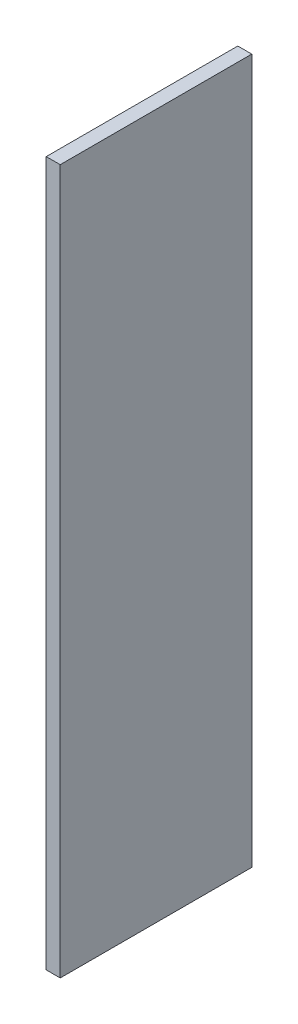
ISO-10303-21;
HEADER;
FILE_DESCRIPTION(('STEP AP214'),'2;1');
FILE_NAME('part.step','',(''),(''),'','','');
FILE_SCHEMA(('AUTOMOTIVE_DESIGN { 1 0 10303 214 1 1 1 1 }'));
ENDSEC;
DATA;
#1=APPLICATION_CONTEXT('core data for automotive mechanical design processes');
#2=APPLICATION_PROTOCOL_DEFINITION('international standard','automotive_design',2000,#1);
#3=PRODUCT_CONTEXT('',#1,'mechanical');
#4=PRODUCT('Part','Part','',(#3));
#5=PRODUCT_RELATED_PRODUCT_CATEGORY('part','',(#4));
#6=PRODUCT_DEFINITION_FORMATION('','',#4);
#7=PRODUCT_DEFINITION_CONTEXT('part definition',#1,'design');
#8=PRODUCT_DEFINITION('design','',#6,#7);
#9=PRODUCT_DEFINITION_SHAPE('','',#8);
#10=(LENGTH_UNIT() NAMED_UNIT(*) SI_UNIT(.MILLI.,.METRE.));
#11=(NAMED_UNIT(*) PLANE_ANGLE_UNIT() SI_UNIT($,.RADIAN.));
#12=(NAMED_UNIT(*) SI_UNIT($,.STERADIAN.) SOLID_ANGLE_UNIT());
#13=UNCERTAINTY_MEASURE_WITH_UNIT(LENGTH_MEASURE(1.E-05),#10,'distance_accuracy_value','');
#14=(GEOMETRIC_REPRESENTATION_CONTEXT(3) GLOBAL_UNCERTAINTY_ASSIGNED_CONTEXT((#13)) GLOBAL_UNIT_ASSIGNED_CONTEXT((#10,
#11,#12)) REPRESENTATION_CONTEXT('',''));
#15=CARTESIAN_POINT('',(0.,0.,0.));
#16=DIRECTION('',(0.,0.,1.));
#17=DIRECTION('',(1.,0.,0.));
#18=AXIS2_PLACEMENT_3D('',#15,#16,#17);
#19=CARTESIAN_POINT('',(-3.74999999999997,-57.5,192.228772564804));
#20=DIRECTION('',(1.,0.,0.));
#21=DIRECTION('',(0.,0.,-1.));
#22=AXIS2_PLACEMENT_3D('',#19,#20,#21);
#23=PLANE('',#22);
#24=DIRECTION('',(0.,-1.,0.));
#25=VECTOR('',#24,1.);
#26=CARTESIAN_POINT('',(-3.74999999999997,-57.5,41.0943887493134));
#27=LINE('',#26,#25);
#28=CARTESIAN_POINT('',(-3.74999999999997,93.604606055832,41.0943887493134));
#29=VERTEX_POINT('',#28);
#30=CARTESIAN_POINT('',(-3.74999999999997,-57.5,41.0943887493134));
#31=VERTEX_POINT('',#30);
#32=EDGE_CURVE('E86',#29,#31,#27,.T.);
#33=ORIENTED_EDGE('',*,*,#32,.F.);
#34=DIRECTION('',(0.,0.,-1.));
#35=VECTOR('',#34,1.);
#36=CARTESIAN_POINT('',(-3.74999999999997,93.604606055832,192.228772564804));
#37=LINE('',#36,#35);
#38=CARTESIAN_POINT('',(-3.74999999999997,93.604606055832,0.));
#39=VERTEX_POINT('',#38);
#40=EDGE_CURVE('E40',#29,#39,#37,.T.);
#41=ORIENTED_EDGE('',*,*,#40,.T.);
#42=DIRECTION('',(0.,-1.,0.));
#43=VECTOR('',#42,1.);
#44=CARTESIAN_POINT('',(-3.74999999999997,-57.5,0.));
#45=LINE('',#44,#43);
#46=CARTESIAN_POINT('',(-3.74999999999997,-57.5,0.));
#47=VERTEX_POINT('',#46);
#48=EDGE_CURVE('E84',#39,#47,#45,.T.);
#49=ORIENTED_EDGE('',*,*,#48,.T.);
#50=DIRECTION('',(0.,0.,-1.));
#51=VECTOR('',#50,1.);
#52=CARTESIAN_POINT('',(-3.74999999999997,-57.5,192.228772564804));
#53=LINE('',#52,#51);
#54=EDGE_CURVE('E75',#31,#47,#53,.T.);
#55=ORIENTED_EDGE('',*,*,#54,.F.);
#56=EDGE_LOOP('',(#33,#41,#49,#55));
#57=FACE_BOUND('',#56,.T.);
#58=ADVANCED_FACE('F36',(#57),#23,.F.);
#59=CARTESIAN_POINT('',(-3.74999999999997,-57.5,192.228772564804));
#60=DIRECTION('',(0.,1.,0.));
#61=DIRECTION('',(0.,0.,1.));
#62=AXIS2_PLACEMENT_3D('',#59,#60,#61);
#63=PLANE('',#62);
#64=DIRECTION('',(1.,0.,0.));
#65=VECTOR('',#64,1.);
#66=CARTESIAN_POINT('',(-3.74999999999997,-57.5,41.0943887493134));
#67=LINE('',#66,#65);
#68=CARTESIAN_POINT('',(-0.749999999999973,-57.5,41.0943887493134));
#69=VERTEX_POINT('',#68);
#70=EDGE_CURVE('E45',#31,#69,#67,.T.);
#71=ORIENTED_EDGE('',*,*,#70,.F.);
#72=ORIENTED_EDGE('',*,*,#54,.T.);
#73=DIRECTION('',(1.,0.,0.));
#74=VECTOR('',#73,1.);
#75=CARTESIAN_POINT('',(-3.74999999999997,-57.5,0.));
#76=LINE('',#75,#74);
#77=CARTESIAN_POINT('',(-0.749999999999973,-57.5,0.));
#78=VERTEX_POINT('',#77);
#79=EDGE_CURVE('E96',#47,#78,#76,.T.);
#80=ORIENTED_EDGE('',*,*,#79,.T.);
#81=DIRECTION('',(0.,0.,-1.));
#82=VECTOR('',#81,1.);
#83=CARTESIAN_POINT('',(-0.749999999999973,-57.5,192.228772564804));
#84=LINE('',#83,#82);
#85=EDGE_CURVE('E105',#69,#78,#84,.T.);
#86=ORIENTED_EDGE('',*,*,#85,.F.);
#87=EDGE_LOOP('',(#71,#72,#80,#86));
#88=FACE_BOUND('',#87,.T.);
#89=ADVANCED_FACE('F109',(#88),#63,.F.);
#90=CARTESIAN_POINT('',(-0.749999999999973,-57.5,192.228772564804));
#91=DIRECTION('',(-1.,0.,0.));
#92=DIRECTION('',(0.,0.,1.));
#93=AXIS2_PLACEMENT_3D('',#90,#91,#92);
#94=PLANE('',#93);
#95=DIRECTION('',(0.,1.,0.));
#96=VECTOR('',#95,1.);
#97=CARTESIAN_POINT('',(-0.749999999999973,-57.5,41.0943887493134));
#98=LINE('',#97,#96);
#99=CARTESIAN_POINT('',(-0.749999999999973,93.604606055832,41.0943887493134));
#100=VERTEX_POINT('',#99);
#101=EDGE_CURVE('E11',#69,#100,#98,.T.);
#102=ORIENTED_EDGE('',*,*,#101,.F.);
#103=ORIENTED_EDGE('',*,*,#85,.T.);
#104=DIRECTION('',(0.,1.,0.));
#105=VECTOR('',#104,1.);
#106=CARTESIAN_POINT('',(-0.749999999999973,-57.5,0.));
#107=LINE('',#106,#105);
#108=CARTESIAN_POINT('',(-0.749999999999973,93.604606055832,0.));
#109=VERTEX_POINT('',#108);
#110=EDGE_CURVE('E106',#78,#109,#107,.T.);
#111=ORIENTED_EDGE('',*,*,#110,.T.);
#112=DIRECTION('',(0.,0.,-1.));
#113=VECTOR('',#112,1.);
#114=CARTESIAN_POINT('',(-0.749999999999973,93.604606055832,192.228772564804));
#115=LINE('',#114,#113);
#116=EDGE_CURVE('E58',#100,#109,#115,.T.);
#117=ORIENTED_EDGE('',*,*,#116,.F.);
#118=EDGE_LOOP('',(#102,#103,#111,#117));
#119=FACE_BOUND('',#118,.T.);
#120=ADVANCED_FACE('F108',(#119),#94,.F.);
#121=CARTESIAN_POINT('',(-3.74999999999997,93.604606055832,192.228772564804));
#122=DIRECTION('',(0.,-1.,0.));
#123=DIRECTION('',(0.,0.,-1.));
#124=AXIS2_PLACEMENT_3D('',#121,#122,#123);
#125=PLANE('',#124);
#126=DIRECTION('',(-1.,0.,0.));
#127=VECTOR('',#126,1.);
#128=CARTESIAN_POINT('',(-3.74999999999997,93.604606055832,41.0943887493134));
#129=LINE('',#128,#127);
#130=EDGE_CURVE('E93',#100,#29,#129,.T.);
#131=ORIENTED_EDGE('',*,*,#130,.F.);
#132=ORIENTED_EDGE('',*,*,#116,.T.);
#133=DIRECTION('',(-1.,0.,0.));
#134=VECTOR('',#133,1.);
#135=CARTESIAN_POINT('',(-3.74999999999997,93.604606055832,0.));
#136=LINE('',#135,#134);
#137=EDGE_CURVE('E89',#109,#39,#136,.T.);
#138=ORIENTED_EDGE('',*,*,#137,.T.);
#139=ORIENTED_EDGE('',*,*,#40,.F.);
#140=EDGE_LOOP('',(#131,#132,#138,#139));
#141=FACE_BOUND('',#140,.T.);
#142=ADVANCED_FACE('F90',(#141),#125,.F.);
#143=CARTESIAN_POINT('',(0.,0.,0.));
#144=DIRECTION('',(0.,0.,-1.));
#145=DIRECTION('',(-1.,0.,0.));
#146=AXIS2_PLACEMENT_3D('',#143,#144,#145);
#147=PLANE('',#146);
#148=ORIENTED_EDGE('',*,*,#48,.F.);
#149=ORIENTED_EDGE('',*,*,#137,.F.);
#150=ORIENTED_EDGE('',*,*,#110,.F.);
#151=ORIENTED_EDGE('',*,*,#79,.F.);
#152=EDGE_LOOP('',(#148,#149,#150,#151));
#153=FACE_BOUND('',#152,.T.);
#154=ADVANCED_FACE('F95',(#153),#147,.T.);
#155=CARTESIAN_POINT('',(-335.722920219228,992.535685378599,41.0943887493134));
#156=DIRECTION('',(0.,0.,1.));
#157=DIRECTION('',(1.,0.,0.));
#158=AXIS2_PLACEMENT_3D('',#155,#156,#157);
#159=PLANE('',#158);
#160=ORIENTED_EDGE('',*,*,#130,.T.);
#161=ORIENTED_EDGE('',*,*,#32,.T.);
#162=ORIENTED_EDGE('',*,*,#70,.T.);
#163=ORIENTED_EDGE('',*,*,#101,.T.);
#164=EDGE_LOOP('',(#160,#161,#162,#163));
#165=FACE_BOUND('',#164,.T.);
#166=ADVANCED_FACE('F38',(#165),#159,.T.);
#167=CLOSED_SHELL('',(#58,#89,#120,#142,#154,#166));
#168=MANIFOLD_SOLID_BREP('B2',#167);
#169=ADVANCED_BREP_SHAPE_REPRESENTATION('',(#18,#168),#14);
#170=SHAPE_DEFINITION_REPRESENTATION(#9,#169);
ENDSEC;
END-ISO-10303-21;
